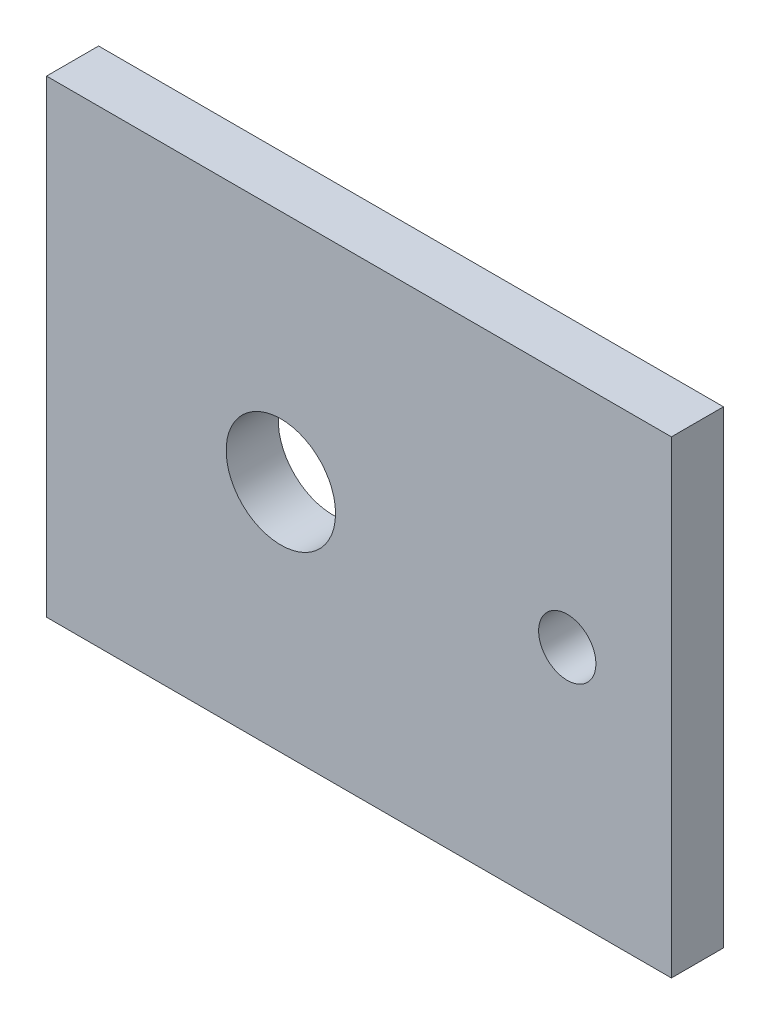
ISO-10303-21;
HEADER;
FILE_DESCRIPTION(('STEP AP214'),'2;1');
FILE_NAME('part.step','',(''),(''),'','','');
FILE_SCHEMA(('AUTOMOTIVE_DESIGN { 1 0 10303 214 1 1 1 1 }'));
ENDSEC;
DATA;
#1=APPLICATION_CONTEXT('core data for automotive mechanical design processes');
#2=APPLICATION_PROTOCOL_DEFINITION('international standard','automotive_design',2000,#1);
#3=PRODUCT_CONTEXT('',#1,'mechanical');
#4=PRODUCT('Part','Part','',(#3));
#5=PRODUCT_RELATED_PRODUCT_CATEGORY('part','',(#4));
#6=PRODUCT_DEFINITION_FORMATION('','',#4);
#7=PRODUCT_DEFINITION_CONTEXT('part definition',#1,'design');
#8=PRODUCT_DEFINITION('design','',#6,#7);
#9=PRODUCT_DEFINITION_SHAPE('','',#8);
#10=(LENGTH_UNIT() NAMED_UNIT(*) SI_UNIT(.MILLI.,.METRE.));
#11=(NAMED_UNIT(*) PLANE_ANGLE_UNIT() SI_UNIT($,.RADIAN.));
#12=(NAMED_UNIT(*) SI_UNIT($,.STERADIAN.) SOLID_ANGLE_UNIT());
#13=UNCERTAINTY_MEASURE_WITH_UNIT(LENGTH_MEASURE(1.E-05),#10,'distance_accuracy_value','');
#14=(GEOMETRIC_REPRESENTATION_CONTEXT(3) GLOBAL_UNCERTAINTY_ASSIGNED_CONTEXT((#13)) GLOBAL_UNIT_ASSIGNED_CONTEXT((#10,
#11,#12)) REPRESENTATION_CONTEXT('',''));
#15=CARTESIAN_POINT('',(0.,0.,0.));
#16=DIRECTION('',(0.,0.,1.));
#17=DIRECTION('',(1.,0.,0.));
#18=AXIS2_PLACEMENT_3D('',#15,#16,#17);
#19=CARTESIAN_POINT('',(0.,90.,10.));
#20=DIRECTION('',(1.,0.,0.));
#21=DIRECTION('',(0.,1.,0.));
#22=AXIS2_PLACEMENT_3D('',#19,#20,#21);
#23=PLANE('',#22);
#24=DIRECTION('',(0.,-1.,0.));
#25=VECTOR('',#24,1.);
#26=CARTESIAN_POINT('',(0.,90.,0.));
#27=LINE('',#26,#25);
#28=CARTESIAN_POINT('',(0.,90.,0.));
#29=VERTEX_POINT('',#28);
#30=CARTESIAN_POINT('',(0.,0.,0.));
#31=VERTEX_POINT('',#30);
#32=EDGE_CURVE('E76',#29,#31,#27,.T.);
#33=ORIENTED_EDGE('',*,*,#32,.T.);
#34=DIRECTION('',(0.,0.,-1.));
#35=VECTOR('',#34,1.);
#36=CARTESIAN_POINT('',(0.,0.,10.));
#37=LINE('',#36,#35);
#38=CARTESIAN_POINT('',(0.,0.,10.));
#39=VERTEX_POINT('',#38);
#40=EDGE_CURVE('E11',#39,#31,#37,.T.);
#41=ORIENTED_EDGE('',*,*,#40,.F.);
#42=DIRECTION('',(0.,-1.,0.));
#43=VECTOR('',#42,1.);
#44=CARTESIAN_POINT('',(0.,90.,10.));
#45=LINE('',#44,#43);
#46=CARTESIAN_POINT('',(0.,90.,10.));
#47=VERTEX_POINT('',#46);
#48=EDGE_CURVE('E99',#47,#39,#45,.T.);
#49=ORIENTED_EDGE('',*,*,#48,.F.);
#50=DIRECTION('',(0.,0.,-1.));
#51=VECTOR('',#50,1.);
#52=CARTESIAN_POINT('',(0.,90.,10.));
#53=LINE('',#52,#51);
#54=EDGE_CURVE('E88',#47,#29,#53,.T.);
#55=ORIENTED_EDGE('',*,*,#54,.T.);
#56=EDGE_LOOP('',(#33,#41,#49,#55));
#57=FACE_BOUND('',#56,.T.);
#58=ADVANCED_FACE('F32',(#57),#23,.F.);
#59=CARTESIAN_POINT('',(0.,0.,10.));
#60=DIRECTION('',(0.,1.,0.));
#61=DIRECTION('',(0.,0.,1.));
#62=AXIS2_PLACEMENT_3D('',#59,#60,#61);
#63=PLANE('',#62);
#64=DIRECTION('',(1.,0.,0.));
#65=VECTOR('',#64,1.);
#66=CARTESIAN_POINT('',(0.,0.,0.));
#67=LINE('',#66,#65);
#68=CARTESIAN_POINT('',(120.,0.,0.));
#69=VERTEX_POINT('',#68);
#70=EDGE_CURVE('E72',#31,#69,#67,.T.);
#71=ORIENTED_EDGE('',*,*,#70,.T.);
#72=DIRECTION('',(0.,0.,-1.));
#73=VECTOR('',#72,1.);
#74=CARTESIAN_POINT('',(120.,0.,10.));
#75=LINE('',#74,#73);
#76=CARTESIAN_POINT('',(120.,0.,10.));
#77=VERTEX_POINT('',#76);
#78=EDGE_CURVE('E39',#77,#69,#75,.T.);
#79=ORIENTED_EDGE('',*,*,#78,.F.);
#80=DIRECTION('',(1.,0.,0.));
#81=VECTOR('',#80,1.);
#82=CARTESIAN_POINT('',(0.,0.,10.));
#83=LINE('',#82,#81);
#84=EDGE_CURVE('E84',#39,#77,#83,.T.);
#85=ORIENTED_EDGE('',*,*,#84,.F.);
#86=ORIENTED_EDGE('',*,*,#40,.T.);
#87=EDGE_LOOP('',(#71,#79,#85,#86));
#88=FACE_BOUND('',#87,.T.);
#89=ADVANCED_FACE('F83',(#88),#63,.F.);
#90=CARTESIAN_POINT('',(120.,0.,10.));
#91=DIRECTION('',(-1.,0.,0.));
#92=DIRECTION('',(0.,0.,1.));
#93=AXIS2_PLACEMENT_3D('',#90,#91,#92);
#94=PLANE('',#93);
#95=DIRECTION('',(0.,1.,0.));
#96=VECTOR('',#95,1.);
#97=CARTESIAN_POINT('',(120.,0.,0.));
#98=LINE('',#97,#96);
#99=CARTESIAN_POINT('',(120.,90.,0.));
#100=VERTEX_POINT('',#99);
#101=EDGE_CURVE('E77',#69,#100,#98,.T.);
#102=ORIENTED_EDGE('',*,*,#101,.T.);
#103=DIRECTION('',(0.,0.,-1.));
#104=VECTOR('',#103,1.);
#105=CARTESIAN_POINT('',(120.,90.,10.));
#106=LINE('',#105,#104);
#107=CARTESIAN_POINT('',(120.,90.,10.));
#108=VERTEX_POINT('',#107);
#109=EDGE_CURVE('E105',#108,#100,#106,.T.);
#110=ORIENTED_EDGE('',*,*,#109,.F.);
#111=DIRECTION('',(0.,1.,0.));
#112=VECTOR('',#111,1.);
#113=CARTESIAN_POINT('',(120.,0.,10.));
#114=LINE('',#113,#112);
#115=EDGE_CURVE('E51',#77,#108,#114,.T.);
#116=ORIENTED_EDGE('',*,*,#115,.F.);
#117=ORIENTED_EDGE('',*,*,#78,.T.);
#118=EDGE_LOOP('',(#102,#110,#116,#117));
#119=FACE_BOUND('',#118,.T.);
#120=ADVANCED_FACE('F108',(#119),#94,.F.);
#121=CARTESIAN_POINT('',(120.,90.,10.));
#122=DIRECTION('',(0.,-1.,0.));
#123=DIRECTION('',(1.,0.,0.));
#124=AXIS2_PLACEMENT_3D('',#121,#122,#123);
#125=PLANE('',#124);
#126=DIRECTION('',(-1.,0.,0.));
#127=VECTOR('',#126,1.);
#128=CARTESIAN_POINT('',(120.,90.,0.));
#129=LINE('',#128,#127);
#130=EDGE_CURVE('E97',#100,#29,#129,.T.);
#131=ORIENTED_EDGE('',*,*,#130,.T.);
#132=ORIENTED_EDGE('',*,*,#54,.F.);
#133=DIRECTION('',(-1.,0.,0.));
#134=VECTOR('',#133,1.);
#135=CARTESIAN_POINT('',(120.,90.,10.));
#136=LINE('',#135,#134);
#137=EDGE_CURVE('E46',#108,#47,#136,.T.);
#138=ORIENTED_EDGE('',*,*,#137,.F.);
#139=ORIENTED_EDGE('',*,*,#109,.T.);
#140=EDGE_LOOP('',(#131,#132,#138,#139));
#141=FACE_BOUND('',#140,.T.);
#142=ADVANCED_FACE('F110',(#141),#125,.F.);
#143=CARTESIAN_POINT('',(0.,0.,10.));
#144=DIRECTION('',(0.,0.,1.));
#145=DIRECTION('',(1.,0.,0.));
#146=AXIS2_PLACEMENT_3D('',#143,#144,#145);
#147=PLANE('',#146);
#148=CARTESIAN_POINT('',(45.,45.,10.));
#149=DIRECTION('',(0.,0.,1.));
#150=DIRECTION('',(1.,0.,0.));
#151=AXIS2_PLACEMENT_3D('',#148,#149,#150);
#152=CIRCLE('',#151,10.5);
#153=CARTESIAN_POINT('',(55.5,45.,10.));
#154=VERTEX_POINT('',#153);
#155=EDGE_CURVE('E177',#154,#154,#152,.T.);
#156=ORIENTED_EDGE('',*,*,#155,.F.);
#157=EDGE_LOOP('',(#156));
#158=FACE_BOUND('',#157,.T.);
#159=CARTESIAN_POINT('',(100.,45.,10.));
#160=DIRECTION('',(0.,0.,1.));
#161=DIRECTION('',(1.,0.,0.));
#162=AXIS2_PLACEMENT_3D('',#159,#160,#161);
#163=CIRCLE('',#162,5.5);
#164=CARTESIAN_POINT('',(105.5,45.,10.));
#165=VERTEX_POINT('',#164);
#166=EDGE_CURVE('E92',#165,#165,#163,.T.);
#167=ORIENTED_EDGE('',*,*,#166,.F.);
#168=EDGE_LOOP('',(#167));
#169=FACE_BOUND('',#168,.T.);
#170=ORIENTED_EDGE('',*,*,#48,.T.);
#171=ORIENTED_EDGE('',*,*,#84,.T.);
#172=ORIENTED_EDGE('',*,*,#115,.T.);
#173=ORIENTED_EDGE('',*,*,#137,.T.);
#174=EDGE_LOOP('',(#170,#171,#172,#173));
#175=FACE_BOUND('',#174,.T.);
#176=ADVANCED_FACE('F111',(#158,#169,#175),#147,.T.);
#177=CARTESIAN_POINT('',(0.,0.,0.));
#178=DIRECTION('',(0.,0.,1.));
#179=DIRECTION('',(1.,0.,0.));
#180=AXIS2_PLACEMENT_3D('',#177,#178,#179);
#181=PLANE('',#180);
#182=CARTESIAN_POINT('',(45.,45.,0.));
#183=DIRECTION('',(0.,0.,1.));
#184=DIRECTION('',(1.,0.,0.));
#185=AXIS2_PLACEMENT_3D('',#182,#183,#184);
#186=CIRCLE('',#185,10.5);
#187=CARTESIAN_POINT('',(55.5,45.,0.));
#188=VERTEX_POINT('',#187);
#189=EDGE_CURVE('E175',#188,#188,#186,.T.);
#190=ORIENTED_EDGE('',*,*,#189,.T.);
#191=EDGE_LOOP('',(#190));
#192=FACE_BOUND('',#191,.T.);
#193=CARTESIAN_POINT('',(100.,45.,0.));
#194=DIRECTION('',(0.,0.,1.));
#195=DIRECTION('',(1.,0.,0.));
#196=AXIS2_PLACEMENT_3D('',#193,#194,#195);
#197=CIRCLE('',#196,5.5);
#198=CARTESIAN_POINT('',(105.5,45.,0.));
#199=VERTEX_POINT('',#198);
#200=EDGE_CURVE('E89',#199,#199,#197,.T.);
#201=ORIENTED_EDGE('',*,*,#200,.T.);
#202=EDGE_LOOP('',(#201));
#203=FACE_BOUND('',#202,.T.);
#204=ORIENTED_EDGE('',*,*,#32,.F.);
#205=ORIENTED_EDGE('',*,*,#130,.F.);
#206=ORIENTED_EDGE('',*,*,#101,.F.);
#207=ORIENTED_EDGE('',*,*,#70,.F.);
#208=EDGE_LOOP('',(#204,#205,#206,#207));
#209=FACE_BOUND('',#208,.T.);
#210=ADVANCED_FACE('F73',(#192,#203,#209),#181,.F.);
#211=CARTESIAN_POINT('',(100.,45.,0.));
#212=DIRECTION('',(0.,0.,1.));
#213=DIRECTION('',(1.,0.,0.));
#214=AXIS2_PLACEMENT_3D('',#211,#212,#213);
#215=CYLINDRICAL_SURFACE('',#214,5.5);
#216=ORIENTED_EDGE('',*,*,#200,.F.);
#217=EDGE_LOOP('',(#216));
#218=FACE_BOUND('',#217,.T.);
#219=ORIENTED_EDGE('',*,*,#166,.T.);
#220=EDGE_LOOP('',(#219));
#221=FACE_BOUND('',#220,.T.);
#222=ADVANCED_FACE('F119',(#218,#221),#215,.F.);
#223=CARTESIAN_POINT('',(45.,45.,0.));
#224=DIRECTION('',(0.,0.,1.));
#225=DIRECTION('',(1.,0.,0.));
#226=AXIS2_PLACEMENT_3D('',#223,#224,#225);
#227=CYLINDRICAL_SURFACE('',#226,10.5);
#228=ORIENTED_EDGE('',*,*,#189,.F.);
#229=EDGE_LOOP('',(#228));
#230=FACE_BOUND('',#229,.T.);
#231=ORIENTED_EDGE('',*,*,#155,.T.);
#232=EDGE_LOOP('',(#231));
#233=FACE_BOUND('',#232,.T.);
#234=ADVANCED_FACE('F148',(#230,#233),#227,.F.);
#235=CLOSED_SHELL('',(#58,#89,#120,#142,#176,#210,#222,#234));
#236=MANIFOLD_SOLID_BREP('B2',#235);
#237=ADVANCED_BREP_SHAPE_REPRESENTATION('',(#18,#236),#14);
#238=SHAPE_DEFINITION_REPRESENTATION(#9,#237);
ENDSEC;
END-ISO-10303-21;
